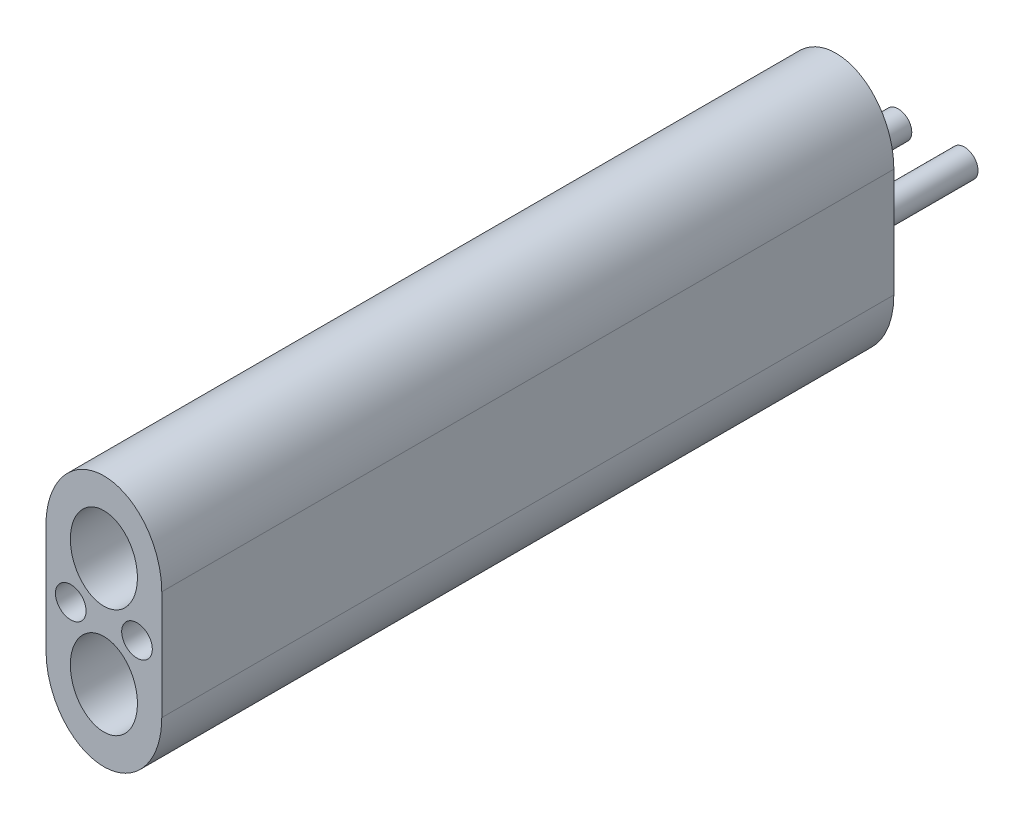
ISO-10303-21;
HEADER;
FILE_DESCRIPTION(('STEP AP214'),'2;1');
FILE_NAME('part.step','',(''),(''),'','','');
FILE_SCHEMA(('AUTOMOTIVE_DESIGN { 1 0 10303 214 1 1 1 1 }'));
ENDSEC;
DATA;
#1=APPLICATION_CONTEXT('core data for automotive mechanical design processes');
#2=APPLICATION_PROTOCOL_DEFINITION('international standard','automotive_design',2000,#1);
#3=PRODUCT_CONTEXT('',#1,'mechanical');
#4=PRODUCT('Part','Part','',(#3));
#5=PRODUCT_RELATED_PRODUCT_CATEGORY('part','',(#4));
#6=PRODUCT_DEFINITION_FORMATION('','',#4);
#7=PRODUCT_DEFINITION_CONTEXT('part definition',#1,'design');
#8=PRODUCT_DEFINITION('design','',#6,#7);
#9=PRODUCT_DEFINITION_SHAPE('','',#8);
#10=(LENGTH_UNIT() NAMED_UNIT(*) SI_UNIT(.MILLI.,.METRE.));
#11=(NAMED_UNIT(*) PLANE_ANGLE_UNIT() SI_UNIT($,.RADIAN.));
#12=(NAMED_UNIT(*) SI_UNIT($,.STERADIAN.) SOLID_ANGLE_UNIT());
#13=UNCERTAINTY_MEASURE_WITH_UNIT(LENGTH_MEASURE(1.E-05),#10,'distance_accuracy_value','');
#14=(GEOMETRIC_REPRESENTATION_CONTEXT(3) GLOBAL_UNCERTAINTY_ASSIGNED_CONTEXT((#13)) GLOBAL_UNIT_ASSIGNED_CONTEXT((#10,
#11,#12)) REPRESENTATION_CONTEXT('',''));
#15=CARTESIAN_POINT('',(0.,0.,0.));
#16=DIRECTION('',(0.,0.,1.));
#17=DIRECTION('',(1.,0.,0.));
#18=AXIS2_PLACEMENT_3D('',#15,#16,#17);
#19=CARTESIAN_POINT('',(0.,0.,-40.));
#20=DIRECTION('',(0.,0.,-1.));
#21=DIRECTION('',(-1.,0.,0.));
#22=AXIS2_PLACEMENT_3D('',#19,#20,#21);
#23=PLANE('',#22);
#24=CARTESIAN_POINT('',(0.,-16.,-40.));
#25=DIRECTION('',(0.,0.,-1.));
#26=DIRECTION('',(0.,-1.,0.));
#27=AXIS2_PLACEMENT_3D('',#24,#25,#26);
#28=ELLIPSE('',#27,6.07894736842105,4.92105263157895);
#29=CARTESIAN_POINT('',(0.,-22.078947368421,-40.));
#30=VERTEX_POINT('',#29);
#31=EDGE_CURVE('E131',#30,#30,#28,.T.);
#32=ORIENTED_EDGE('',*,*,#31,.F.);
#33=EDGE_LOOP('',(#32));
#34=FACE_BOUND('',#33,.T.);
#35=CARTESIAN_POINT('',(0.,0.,-40.));
#36=DIRECTION('',(0.,0.,-1.));
#37=DIRECTION('',(0.,1.,0.));
#38=AXIS2_PLACEMENT_3D('',#35,#36,#37);
#39=ELLIPSE('',#38,10.5,8.5);
#40=CARTESIAN_POINT('',(-8.5,0.,-40.));
#41=VERTEX_POINT('',#40);
#42=CARTESIAN_POINT('',(8.5,0.,-40.));
#43=VERTEX_POINT('',#42);
#44=EDGE_CURVE('E105',#41,#43,#39,.T.);
#45=ORIENTED_EDGE('',*,*,#44,.T.);
#46=DIRECTION('',(0.,-1.,0.));
#47=VECTOR('',#46,1.);
#48=CARTESIAN_POINT('',(8.5,0.,-40.));
#49=LINE('',#48,#47);
#50=CARTESIAN_POINT('',(8.5,-16.,-40.));
#51=VERTEX_POINT('',#50);
#52=EDGE_CURVE('E139',#43,#51,#49,.T.);
#53=ORIENTED_EDGE('',*,*,#52,.T.);
#54=CARTESIAN_POINT('',(0.,-16.,-40.));
#55=DIRECTION('',(0.,0.,-1.));
#56=DIRECTION('',(0.,-1.,0.));
#57=AXIS2_PLACEMENT_3D('',#54,#55,#56);
#58=ELLIPSE('',#57,10.5,8.5);
#59=CARTESIAN_POINT('',(-8.5,-16.,-40.));
#60=VERTEX_POINT('',#59);
#61=EDGE_CURVE('E78',#51,#60,#58,.T.);
#62=ORIENTED_EDGE('',*,*,#61,.T.);
#63=DIRECTION('',(0.,1.,0.));
#64=VECTOR('',#63,1.);
#65=CARTESIAN_POINT('',(-8.5,-16.,-40.));
#66=LINE('',#65,#64);
#67=EDGE_CURVE('E73',#60,#41,#66,.T.);
#68=ORIENTED_EDGE('',*,*,#67,.T.);
#69=EDGE_LOOP('',(#45,#53,#62,#68));
#70=FACE_BOUND('',#69,.T.);
#71=CARTESIAN_POINT('',(0.,0.,-40.));
#72=DIRECTION('',(0.,0.,-1.));
#73=DIRECTION('',(0.,1.,0.));
#74=AXIS2_PLACEMENT_3D('',#71,#72,#73);
#75=ELLIPSE('',#74,6.07894736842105,4.92105263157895);
#76=CARTESIAN_POINT('',(0.,6.07894736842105,-40.));
#77=VERTEX_POINT('',#76);
#78=EDGE_CURVE('E134',#77,#77,#75,.T.);
#79=ORIENTED_EDGE('',*,*,#78,.F.);
#80=EDGE_LOOP('',(#79));
#81=FACE_BOUND('',#80,.T.);
#82=CARTESIAN_POINT('',(-4.86306893,-8.,-40.));
#83=DIRECTION('',(0.,0.,-1.));
#84=DIRECTION('',(-1.,0.,0.));
#85=AXIS2_PLACEMENT_3D('',#82,#83,#84);
#86=CIRCLE('',#85,2.);
#87=CARTESIAN_POINT('',(-6.86306893,-8.,-40.));
#88=VERTEX_POINT('',#87);
#89=EDGE_CURVE('E12',#88,#88,#86,.T.);
#90=ORIENTED_EDGE('',*,*,#89,.F.);
#91=EDGE_LOOP('',(#90));
#92=FACE_BOUND('',#91,.T.);
#93=CARTESIAN_POINT('',(4.86306893,-8.,-40.));
#94=DIRECTION('',(0.,0.,-1.));
#95=DIRECTION('',(-1.,0.,0.));
#96=AXIS2_PLACEMENT_3D('',#93,#94,#95);
#97=CIRCLE('',#96,2.);
#98=CARTESIAN_POINT('',(2.86306893,-8.,-40.));
#99=VERTEX_POINT('',#98);
#100=EDGE_CURVE('E179',#99,#99,#97,.T.);
#101=ORIENTED_EDGE('',*,*,#100,.F.);
#102=EDGE_LOOP('',(#101));
#103=FACE_BOUND('',#102,.T.);
#104=ADVANCED_FACE('F58',(#34,#70,#81,#92,#103),#23,.T.);
#105=CARTESIAN_POINT('',(0.,-16.0000000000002,6.99999999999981));
#106=DIRECTION('',(0.,0.,1.));
#107=DIRECTION('',(0.,-1.,0.));
#108=AXIS2_PLACEMENT_3D('',#105,#106,#107);
#109=ELLIPSE('',#108,6.07894736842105,4.92105263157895);
#110=DIRECTION('',(0.,0.,-1.));
#111=VECTOR('',#110,1.);
#112=SURFACE_OF_LINEAR_EXTRUSION('',#109,#111);
#113=ORIENTED_EDGE('',*,*,#31,.T.);
#114=EDGE_LOOP('',(#113));
#115=FACE_BOUND('',#114,.T.);
#116=CARTESIAN_POINT('',(0.,-16.,67.5));
#117=DIRECTION('',(0.,0.,1.));
#118=DIRECTION('',(0.,-1.,0.));
#119=AXIS2_PLACEMENT_3D('',#116,#117,#118);
#120=ELLIPSE('',#119,6.07894736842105,4.92105263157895);
#121=CARTESIAN_POINT('',(0.,-22.078947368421,67.5));
#122=VERTEX_POINT('',#121);
#123=EDGE_CURVE('E125',#122,#122,#120,.T.);
#124=ORIENTED_EDGE('',*,*,#123,.T.);
#125=EDGE_LOOP('',(#124));
#126=FACE_BOUND('',#125,.T.);
#127=ADVANCED_FACE('F151',(#115,#126),#112,.T.);
#128=CARTESIAN_POINT('',(0.,1.96023752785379E-13,6.99999999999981));
#129=DIRECTION('',(0.,0.,-1.));
#130=DIRECTION('',(0.,1.,0.));
#131=AXIS2_PLACEMENT_3D('',#128,#129,#130);
#132=ELLIPSE('',#131,6.07894736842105,4.92105263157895);
#133=DIRECTION('',(0.,0.,-1.));
#134=VECTOR('',#133,1.);
#135=SURFACE_OF_LINEAR_EXTRUSION('',#132,#134);
#136=ORIENTED_EDGE('',*,*,#78,.T.);
#137=EDGE_LOOP('',(#136));
#138=FACE_BOUND('',#137,.T.);
#139=CARTESIAN_POINT('',(0.,0.,67.5));
#140=DIRECTION('',(0.,0.,1.));
#141=DIRECTION('',(0.,1.,0.));
#142=AXIS2_PLACEMENT_3D('',#139,#140,#141);
#143=ELLIPSE('',#142,6.07894736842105,4.92105263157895);
#144=CARTESIAN_POINT('',(0.,6.07894736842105,67.5));
#145=VERTEX_POINT('',#144);
#146=EDGE_CURVE('E122',#145,#145,#143,.T.);
#147=ORIENTED_EDGE('',*,*,#146,.T.);
#148=EDGE_LOOP('',(#147));
#149=FACE_BOUND('',#148,.T.);
#150=ADVANCED_FACE('F147',(#138,#149),#135,.F.);
#151=CARTESIAN_POINT('',(8.5,-16.,500000.));
#152=DIRECTION('',(1.,0.,0.));
#153=DIRECTION('',(0.,0.,-1.));
#154=AXIS2_PLACEMENT_3D('',#151,#152,#153);
#155=PLANE('',#154);
#156=DIRECTION('',(0.,0.,1.));
#157=VECTOR('',#156,1.);
#158=CARTESIAN_POINT('',(8.5,0.,-40.));
#159=LINE('',#158,#157);
#160=CARTESIAN_POINT('',(8.5,0.,67.5));
#161=VERTEX_POINT('',#160);
#162=EDGE_CURVE('E66',#43,#161,#159,.T.);
#163=ORIENTED_EDGE('',*,*,#162,.T.);
#164=DIRECTION('',(0.,1.,0.));
#165=VECTOR('',#164,1.);
#166=CARTESIAN_POINT('',(8.5,-16.,67.5));
#167=LINE('',#166,#165);
#168=CARTESIAN_POINT('',(8.5,-16.,67.5));
#169=VERTEX_POINT('',#168);
#170=EDGE_CURVE('E121',#169,#161,#167,.T.);
#171=ORIENTED_EDGE('',*,*,#170,.F.);
#172=DIRECTION('',(0.,0.,1.));
#173=VECTOR('',#172,1.);
#174=CARTESIAN_POINT('',(8.5,-16.,-40.));
#175=LINE('',#174,#173);
#176=EDGE_CURVE('E159',#51,#169,#175,.T.);
#177=ORIENTED_EDGE('',*,*,#176,.F.);
#178=ORIENTED_EDGE('',*,*,#52,.F.);
#179=EDGE_LOOP('',(#163,#171,#177,#178));
#180=FACE_BOUND('',#179,.T.);
#181=ADVANCED_FACE('F60',(#180),#155,.T.);
#182=CARTESIAN_POINT('',(-8.5,0.,500000.));
#183=DIRECTION('',(-1.,0.,0.));
#184=DIRECTION('',(0.,0.,1.));
#185=AXIS2_PLACEMENT_3D('',#182,#183,#184);
#186=PLANE('',#185);
#187=DIRECTION('',(0.,0.,1.));
#188=VECTOR('',#187,1.);
#189=CARTESIAN_POINT('',(-8.5,-16.,-40.));
#190=LINE('',#189,#188);
#191=CARTESIAN_POINT('',(-8.5,-16.,67.5));
#192=VERTEX_POINT('',#191);
#193=EDGE_CURVE('E107',#60,#192,#190,.T.);
#194=ORIENTED_EDGE('',*,*,#193,.T.);
#195=DIRECTION('',(0.,-1.,0.));
#196=VECTOR('',#195,1.);
#197=CARTESIAN_POINT('',(-8.5,0.,67.5));
#198=LINE('',#197,#196);
#199=CARTESIAN_POINT('',(-8.5,0.,67.5));
#200=VERTEX_POINT('',#199);
#201=EDGE_CURVE('E110',#200,#192,#198,.T.);
#202=ORIENTED_EDGE('',*,*,#201,.F.);
#203=DIRECTION('',(0.,0.,1.));
#204=VECTOR('',#203,1.);
#205=CARTESIAN_POINT('',(-8.5,0.,-40.));
#206=LINE('',#205,#204);
#207=EDGE_CURVE('E99',#41,#200,#206,.T.);
#208=ORIENTED_EDGE('',*,*,#207,.F.);
#209=ORIENTED_EDGE('',*,*,#67,.F.);
#210=EDGE_LOOP('',(#194,#202,#208,#209));
#211=FACE_BOUND('',#210,.T.);
#212=ADVANCED_FACE('F111',(#211),#186,.T.);
#213=DIRECTION('',(0.,0.,1.));
#214=VECTOR('',#213,1.);
#215=SURFACE_OF_LINEAR_EXTRUSION('',#39,#214);
#216=ORIENTED_EDGE('',*,*,#207,.T.);
#217=CARTESIAN_POINT('',(0.,0.,67.5));
#218=DIRECTION('',(0.,0.,1.));
#219=DIRECTION('',(0.,1.,0.));
#220=AXIS2_PLACEMENT_3D('',#217,#218,#219);
#221=ELLIPSE('',#220,10.5,8.5);
#222=EDGE_CURVE('E104',#161,#200,#221,.T.);
#223=ORIENTED_EDGE('',*,*,#222,.F.);
#224=ORIENTED_EDGE('',*,*,#162,.F.);
#225=ORIENTED_EDGE('',*,*,#44,.F.);
#226=EDGE_LOOP('',(#216,#223,#224,#225));
#227=FACE_BOUND('',#226,.T.);
#228=ADVANCED_FACE('F101',(#227),#215,.F.);
#229=DIRECTION('',(0.,0.,1.));
#230=VECTOR('',#229,1.);
#231=SURFACE_OF_LINEAR_EXTRUSION('',#58,#230);
#232=ORIENTED_EDGE('',*,*,#176,.T.);
#233=CARTESIAN_POINT('',(0.,-16.,67.5));
#234=DIRECTION('',(0.,0.,1.));
#235=DIRECTION('',(0.,-1.,0.));
#236=AXIS2_PLACEMENT_3D('',#233,#234,#235);
#237=ELLIPSE('',#236,10.5,8.5);
#238=EDGE_CURVE('E115',#192,#169,#237,.T.);
#239=ORIENTED_EDGE('',*,*,#238,.F.);
#240=ORIENTED_EDGE('',*,*,#193,.F.);
#241=ORIENTED_EDGE('',*,*,#61,.F.);
#242=EDGE_LOOP('',(#232,#239,#240,#241));
#243=FACE_BOUND('',#242,.T.);
#244=ADVANCED_FACE('F145',(#243),#231,.F.);
#245=CARTESIAN_POINT('',(0.,0.,67.5));
#246=DIRECTION('',(0.,0.,1.));
#247=DIRECTION('',(1.,0.,0.));
#248=AXIS2_PLACEMENT_3D('',#245,#246,#247);
#249=PLANE('',#248);
#250=CARTESIAN_POINT('',(4.86306893,-8.,67.5));
#251=DIRECTION('',(0.,0.,1.));
#252=DIRECTION('',(1.,0.,0.));
#253=AXIS2_PLACEMENT_3D('',#250,#251,#252);
#254=CIRCLE('',#253,2.25);
#255=CARTESIAN_POINT('',(7.11306893,-8.,67.5));
#256=VERTEX_POINT('',#255);
#257=EDGE_CURVE('E241',#256,#256,#254,.T.);
#258=ORIENTED_EDGE('',*,*,#257,.F.);
#259=EDGE_LOOP('',(#258));
#260=FACE_BOUND('',#259,.T.);
#261=CARTESIAN_POINT('',(-4.86306893,-8.,67.5));
#262=DIRECTION('',(0.,0.,1.));
#263=DIRECTION('',(1.,0.,0.));
#264=AXIS2_PLACEMENT_3D('',#261,#262,#263);
#265=CIRCLE('',#264,2.25);
#266=CARTESIAN_POINT('',(-2.61306893,-8.,67.5));
#267=VERTEX_POINT('',#266);
#268=EDGE_CURVE('E190',#267,#267,#265,.T.);
#269=ORIENTED_EDGE('',*,*,#268,.F.);
#270=EDGE_LOOP('',(#269));
#271=FACE_BOUND('',#270,.T.);
#272=ORIENTED_EDGE('',*,*,#146,.F.);
#273=EDGE_LOOP('',(#272));
#274=FACE_BOUND('',#273,.T.);
#275=ORIENTED_EDGE('',*,*,#222,.T.);
#276=ORIENTED_EDGE('',*,*,#201,.T.);
#277=ORIENTED_EDGE('',*,*,#238,.T.);
#278=ORIENTED_EDGE('',*,*,#170,.T.);
#279=EDGE_LOOP('',(#275,#276,#277,#278));
#280=FACE_BOUND('',#279,.T.);
#281=ORIENTED_EDGE('',*,*,#123,.F.);
#282=EDGE_LOOP('',(#281));
#283=FACE_BOUND('',#282,.T.);
#284=ADVANCED_FACE('F118',(#260,#271,#274,#280,#283),#249,.T.);
#285=CARTESIAN_POINT('',(-4.86306893,-8.,-54.));
#286=DIRECTION('',(0.,0.,1.));
#287=DIRECTION('',(1.,0.,0.));
#288=AXIS2_PLACEMENT_3D('',#285,#286,#287);
#289=CYLINDRICAL_SURFACE('',#288,2.);
#290=CARTESIAN_POINT('',(-4.86306893,-8.,-54.));
#291=DIRECTION('',(0.,0.,1.));
#292=DIRECTION('',(1.,0.,0.));
#293=AXIS2_PLACEMENT_3D('',#290,#291,#292);
#294=CIRCLE('',#293,2.);
#295=CARTESIAN_POINT('',(-2.86306893,-8.,-54.));
#296=VERTEX_POINT('',#295);
#297=EDGE_CURVE('E181',#296,#296,#294,.T.);
#298=ORIENTED_EDGE('',*,*,#297,.T.);
#299=EDGE_LOOP('',(#298));
#300=FACE_BOUND('',#299,.T.);
#301=ORIENTED_EDGE('',*,*,#89,.T.);
#302=EDGE_LOOP('',(#301));
#303=FACE_BOUND('',#302,.T.);
#304=ADVANCED_FACE('F196',(#300,#303),#289,.T.);
#305=CARTESIAN_POINT('',(-4.86306893,-8.,-54.));
#306=DIRECTION('',(0.,0.,1.));
#307=DIRECTION('',(1.,0.,0.));
#308=AXIS2_PLACEMENT_3D('',#305,#306,#307);
#309=PLANE('',#308);
#310=ORIENTED_EDGE('',*,*,#297,.F.);
#311=EDGE_LOOP('',(#310));
#312=FACE_BOUND('',#311,.T.);
#313=ADVANCED_FACE('F203',(#312),#309,.F.);
#314=CARTESIAN_POINT('',(4.86306893,-8.,-54.));
#315=DIRECTION('',(0.,0.,1.));
#316=DIRECTION('',(1.,0.,0.));
#317=AXIS2_PLACEMENT_3D('',#314,#315,#316);
#318=CYLINDRICAL_SURFACE('',#317,2.);
#319=CARTESIAN_POINT('',(4.86306893,-8.,-54.));
#320=DIRECTION('',(0.,0.,-1.));
#321=DIRECTION('',(-1.,0.,0.));
#322=AXIS2_PLACEMENT_3D('',#319,#320,#321);
#323=CIRCLE('',#322,2.);
#324=CARTESIAN_POINT('',(2.86306893,-8.,-54.));
#325=VERTEX_POINT('',#324);
#326=EDGE_CURVE('E182',#325,#325,#323,.T.);
#327=ORIENTED_EDGE('',*,*,#326,.F.);
#328=EDGE_LOOP('',(#327));
#329=FACE_BOUND('',#328,.T.);
#330=ORIENTED_EDGE('',*,*,#100,.T.);
#331=EDGE_LOOP('',(#330));
#332=FACE_BOUND('',#331,.T.);
#333=ADVANCED_FACE('F212',(#329,#332),#318,.T.);
#334=CARTESIAN_POINT('',(4.86306893,-8.,-54.));
#335=DIRECTION('',(0.,0.,-1.));
#336=DIRECTION('',(-1.,0.,0.));
#337=AXIS2_PLACEMENT_3D('',#334,#335,#336);
#338=PLANE('',#337);
#339=ORIENTED_EDGE('',*,*,#326,.T.);
#340=EDGE_LOOP('',(#339));
#341=FACE_BOUND('',#340,.T.);
#342=ADVANCED_FACE('F214',(#341),#338,.T.);
#343=CARTESIAN_POINT('',(-4.86306893,-8.,52.5));
#344=DIRECTION('',(0.,0.,1.));
#345=DIRECTION('',(1.,0.,0.));
#346=AXIS2_PLACEMENT_3D('',#343,#344,#345);
#347=CYLINDRICAL_SURFACE('',#346,2.25);
#348=CARTESIAN_POINT('',(-4.86306893,-8.,52.5));
#349=DIRECTION('',(0.,0.,1.));
#350=DIRECTION('',(1.,0.,0.));
#351=AXIS2_PLACEMENT_3D('',#348,#349,#350);
#352=CIRCLE('',#351,2.25);
#353=CARTESIAN_POINT('',(-2.61306893,-8.,52.5));
#354=VERTEX_POINT('',#353);
#355=EDGE_CURVE('E187',#354,#354,#352,.T.);
#356=ORIENTED_EDGE('',*,*,#355,.F.);
#357=EDGE_LOOP('',(#356));
#358=FACE_BOUND('',#357,.T.);
#359=ORIENTED_EDGE('',*,*,#268,.T.);
#360=EDGE_LOOP('',(#359));
#361=FACE_BOUND('',#360,.T.);
#362=ADVANCED_FACE('F217',(#358,#361),#347,.F.);
#363=CARTESIAN_POINT('',(-4.86306893,-8.,52.5));
#364=DIRECTION('',(0.,0.,1.));
#365=DIRECTION('',(1.,0.,0.));
#366=AXIS2_PLACEMENT_3D('',#363,#364,#365);
#367=PLANE('',#366);
#368=ORIENTED_EDGE('',*,*,#355,.T.);
#369=EDGE_LOOP('',(#368));
#370=FACE_BOUND('',#369,.T.);
#371=ADVANCED_FACE('F224',(#370),#367,.T.);
#372=CARTESIAN_POINT('',(4.86306893,-8.,52.5));
#373=DIRECTION('',(0.,0.,1.));
#374=DIRECTION('',(1.,0.,0.));
#375=AXIS2_PLACEMENT_3D('',#372,#373,#374);
#376=CYLINDRICAL_SURFACE('',#375,2.25);
#377=CARTESIAN_POINT('',(4.86306893,-8.,52.5));
#378=DIRECTION('',(0.,0.,1.));
#379=DIRECTION('',(1.,0.,0.));
#380=AXIS2_PLACEMENT_3D('',#377,#378,#379);
#381=CIRCLE('',#380,2.25);
#382=CARTESIAN_POINT('',(7.11306893,-8.,52.5));
#383=VERTEX_POINT('',#382);
#384=EDGE_CURVE('E240',#383,#383,#381,.T.);
#385=ORIENTED_EDGE('',*,*,#384,.F.);
#386=EDGE_LOOP('',(#385));
#387=FACE_BOUND('',#386,.T.);
#388=ORIENTED_EDGE('',*,*,#257,.T.);
#389=EDGE_LOOP('',(#388));
#390=FACE_BOUND('',#389,.T.);
#391=ADVANCED_FACE('F228',(#387,#390),#376,.F.);
#392=CARTESIAN_POINT('',(4.86306893,-8.,52.5));
#393=DIRECTION('',(0.,0.,1.));
#394=DIRECTION('',(1.,0.,0.));
#395=AXIS2_PLACEMENT_3D('',#392,#393,#394);
#396=PLANE('',#395);
#397=ORIENTED_EDGE('',*,*,#384,.T.);
#398=EDGE_LOOP('',(#397));
#399=FACE_BOUND('',#398,.T.);
#400=ADVANCED_FACE('F232',(#399),#396,.T.);
#401=CLOSED_SHELL('',(#104,#127,#150,#181,#212,#228,#244,#284,#304,#313,#333,#342,#362,#371,
#391,#400));
#402=MANIFOLD_SOLID_BREP('B2',#401);
#403=ADVANCED_BREP_SHAPE_REPRESENTATION('',(#18,#402),#14);
#404=SHAPE_DEFINITION_REPRESENTATION(#9,#403);
ENDSEC;
END-ISO-10303-21;
